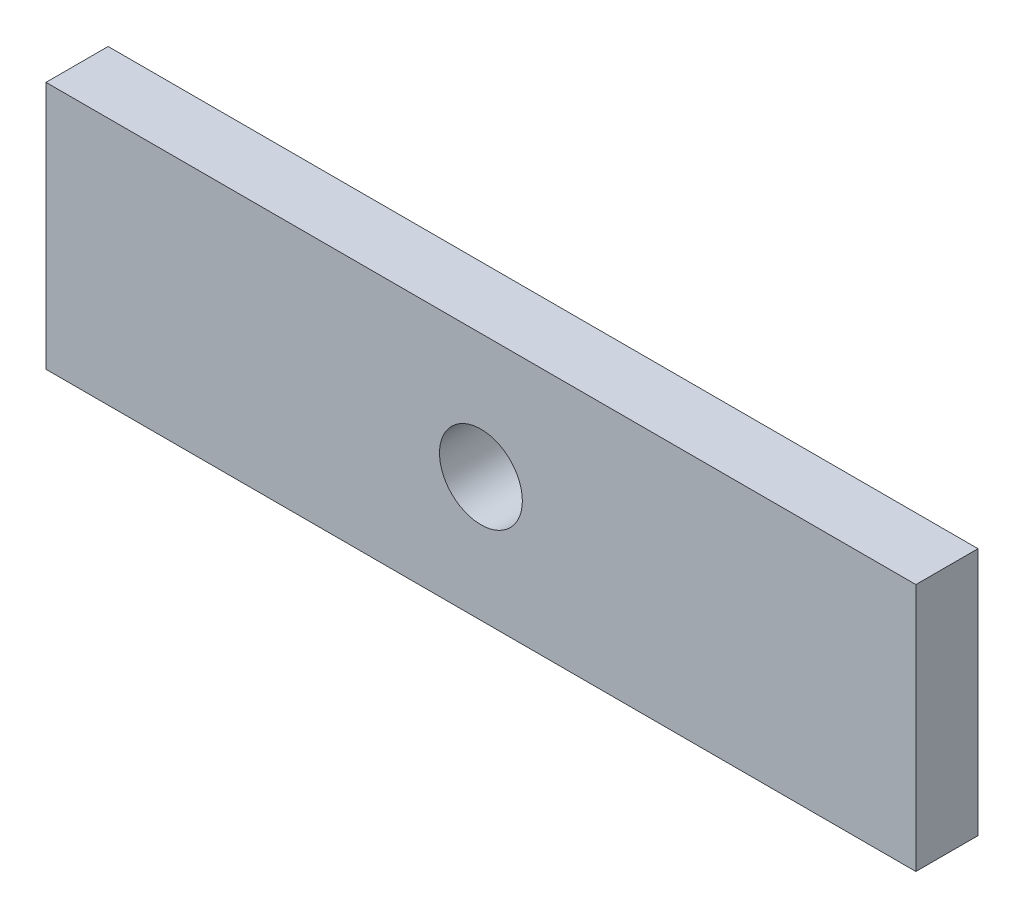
from build123d import *

# Parameters (mm, degrees)
SKETCH1_W      = 420
SKETCH1_H      = 120
SKETCH1_R      = 20
EXTRUDE1_DEPTH = 30


with BuildPart() as part:
    # Sketch1 → Extrude1 (new body)
    with BuildSketch(Plane.XY):
        with Locations((210, 60)):
            Rectangle(SKETCH1_W, SKETCH1_H)
        with Locations((210, 60)):
            Circle(SKETCH1_R, mode=Mode.SUBTRACT)
    extrude(amount=EXTRUDE1_DEPTH)


solid = part.part
